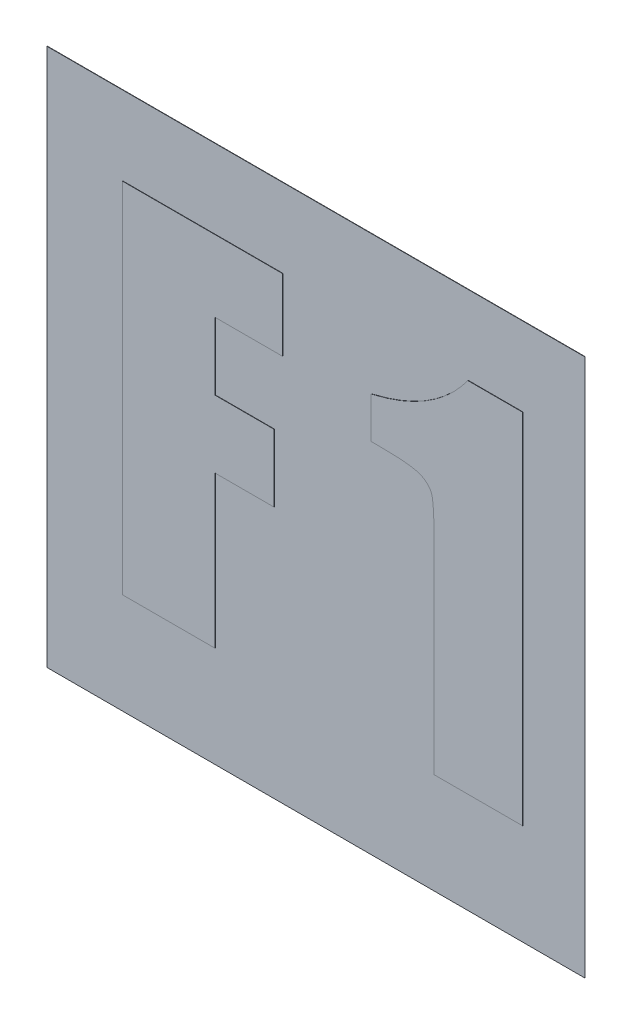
from build123d import *

# Parameters (mm, degrees)
SKETCH1_W           = 15
SKETCH1_H           = 15
BASE_EXTRUDE_DEPTH  = 0.01
BOSS_EXTRUDE1_DEPTH = 0.01


with BuildPart() as part:
    # Sketch1 → Base-Extrude (new body)
    with BuildSketch(Plane.XY):
        Rectangle(SKETCH1_W, SKETCH1_H)
    extrude(amount=BASE_EXTRUDE_DEPTH)

    # Sketch3 → Boss-Extrude1 (add)
    with BuildSketch(Plane.XY.offset(0.01)):
        Polygon((-5.384794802, 5.306205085), (-0.919413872, 5.306205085), (-0.919413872, 3.308534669), (-2.799574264, 3.308534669), (-2.799574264, 1.428374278), (-1.154433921, 1.428374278), (-1.154433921, -0.451786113), (-2.799574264, -0.451786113), (-2.799574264, -4.682146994), (-5.384794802, -4.682146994), align=None)
        with BuildLine():
            Line((5.778657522, 5.306205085), (5.778657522, -4.682146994))
            Line((5.778657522, -4.682146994), (3.310947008, -4.682146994))
            Line((3.310947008, -4.682146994), (3.310947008, 0.631509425))
            add(Edge.make_bspline(
                [(3.310947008, 0.631509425), (3.311365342, 0.722705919), (3.312157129, 0.895315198), (3.306902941, 1.140099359), (3.305115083, 1.356227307), (3.29663727, 1.543462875), (3.289754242, 1.702011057), (3.28210286, 1.832060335), (3.268629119, 1.932937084), (3.253452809, 2.029125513), (3.218364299, 2.126245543), (3.149902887, 2.224742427), (3.055027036, 2.30592508), (2.957850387, 2.361661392), (2.86133248, 2.397721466), (2.767354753, 2.419754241), (2.654999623, 2.442924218), (2.522270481, 2.457900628), (2.369827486, 2.470808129), (2.197743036, 2.479518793), (2.006133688, 2.485064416), (1.87206589, 2.485654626), (1.801677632, 2.485964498)],
                knots=[0, 0, 0, 0, 1.80900232, 3.423931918, 4.856770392, 6.096099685, 7.14135061, 8.005493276, 8.678632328, 9.159696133, 9.935578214, 10.70343964, 11.512067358, 12.393018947, 12.911680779, 13.550668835, 14.305461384, 15.186412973, 16.197689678, 17.340552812, 18.60373737, 20, 20, 20, 20], degree=3))
            Line((1.801677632, 2.485964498), (1.548296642, 2.485964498))
            Line((1.548296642, 2.485964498), (1.548296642, 3.631687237))
            add(Edge.make_bspline(
                [(1.548296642, 3.631687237), (1.692768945, 3.668008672), (1.97564938, 3.739126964), (2.381568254, 3.881832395), (2.761461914, 4.050628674), (3.11452453, 4.24679379), (3.440527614, 4.470451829), (3.738971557, 4.721598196), (4.0130797, 4.998312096), (4.171649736, 5.203494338), (4.251027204, 5.306205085)],
                knots=[0, 0, 0, 0, 1.099490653, 2.152830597, 3.172387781, 4.165697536, 5.130894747, 6.086768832, 7.042268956, 8, 8, 8, 8], degree=3))
            Line((4.251027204, 5.306205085), (5.778657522, 5.306205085))
        make_face()
    extrude(amount=BOSS_EXTRUDE1_DEPTH)


solid = part.part
